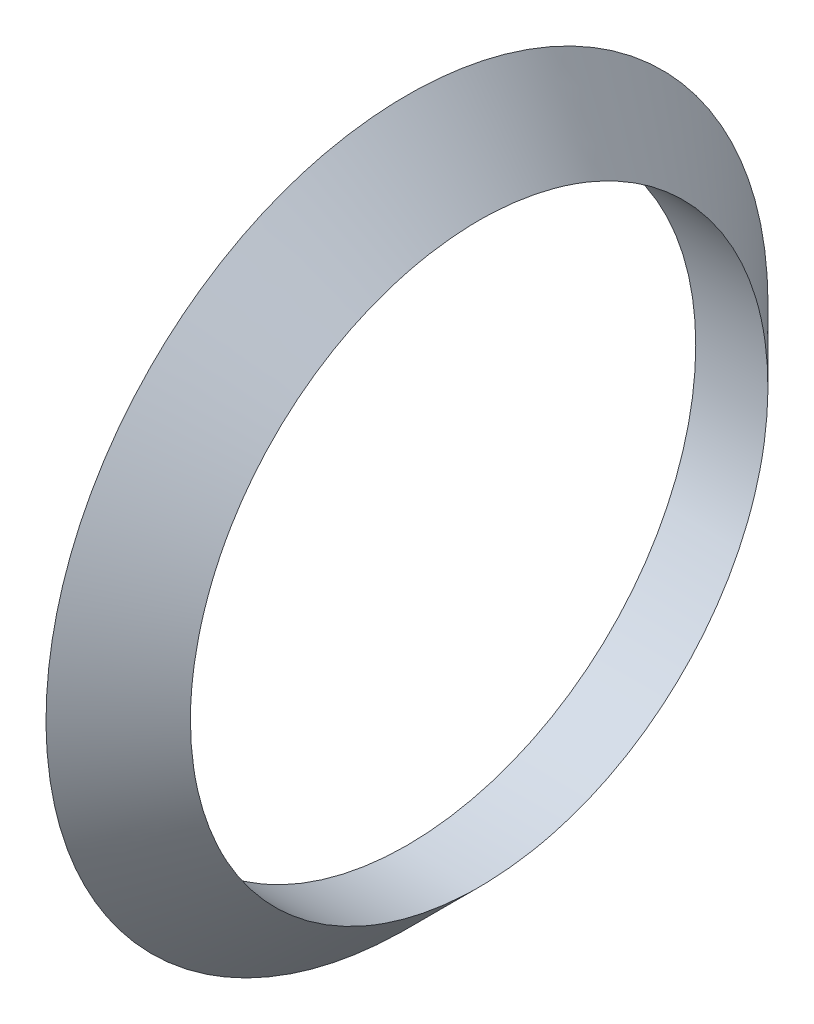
ISO-10303-21;
HEADER;
FILE_DESCRIPTION(('STEP AP214'),'2;1');
FILE_NAME('part.step','',(''),(''),'','','');
FILE_SCHEMA(('AUTOMOTIVE_DESIGN { 1 0 10303 214 1 1 1 1 }'));
ENDSEC;
DATA;
#1=APPLICATION_CONTEXT('core data for automotive mechanical design processes');
#2=APPLICATION_PROTOCOL_DEFINITION('international standard','automotive_design',2000,#1);
#3=PRODUCT_CONTEXT('',#1,'mechanical');
#4=PRODUCT('Part','Part','',(#3));
#5=PRODUCT_RELATED_PRODUCT_CATEGORY('part','',(#4));
#6=PRODUCT_DEFINITION_FORMATION('','',#4);
#7=PRODUCT_DEFINITION_CONTEXT('part definition',#1,'design');
#8=PRODUCT_DEFINITION('design','',#6,#7);
#9=PRODUCT_DEFINITION_SHAPE('','',#8);
#10=(LENGTH_UNIT() NAMED_UNIT(*) SI_UNIT(.MILLI.,.METRE.));
#11=(NAMED_UNIT(*) PLANE_ANGLE_UNIT() SI_UNIT($,.RADIAN.));
#12=(NAMED_UNIT(*) SI_UNIT($,.STERADIAN.) SOLID_ANGLE_UNIT());
#13=UNCERTAINTY_MEASURE_WITH_UNIT(LENGTH_MEASURE(1.E-05),#10,'distance_accuracy_value','');
#14=(GEOMETRIC_REPRESENTATION_CONTEXT(3) GLOBAL_UNCERTAINTY_ASSIGNED_CONTEXT((#13)) GLOBAL_UNIT_ASSIGNED_CONTEXT((#10,
#11,#12)) REPRESENTATION_CONTEXT('',''));
#15=CARTESIAN_POINT('',(0.,0.,0.));
#16=DIRECTION('',(0.,0.,1.));
#17=DIRECTION('',(1.,0.,0.));
#18=AXIS2_PLACEMENT_3D('',#15,#16,#17);
#19=CARTESIAN_POINT('',(152.,55.,27.));
#20=DIRECTION('',(-1.,0.,0.));
#21=DIRECTION('',(0.,0.,1.));
#22=AXIS2_PLACEMENT_3D('',#19,#20,#21);
#23=PLANE('',#22);
#24=CARTESIAN_POINT('',(152.,-1.10352807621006E-11,19.9998724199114));
#25=CARTESIAN_POINT('',(152.,0.244989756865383,19.9998783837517));
#26=CARTESIAN_POINT('',(152.,0.489954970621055,19.9955088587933));
#27=CARTESIAN_POINT('',(152.,0.979565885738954,19.9778506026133));
#28=CARTESIAN_POINT('',(152.,1.22421160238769,19.9645623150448));
#29=CARTESIAN_POINT('',(152.,1.71283709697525,19.9290391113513));
#30=CARTESIAN_POINT('',(152.,1.95681691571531,19.9068047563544));
#31=CARTESIAN_POINT('',(152.,2.44383325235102,19.8534078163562));
#32=CARTESIAN_POINT('',(152.,2.68686957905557,19.8222435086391));
#33=CARTESIAN_POINT('',(152.,3.41415854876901,19.7153111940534));
#34=CARTESIAN_POINT('',(152.,3.89651224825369,19.6261095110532));
#35=CARTESIAN_POINT('',(152.,4.853249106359,19.4122585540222));
#36=CARTESIAN_POINT('',(152.,5.3276319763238,19.2876079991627));
#37=CARTESIAN_POINT('',(152.,6.33487882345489,18.9825905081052));
#38=CARTESIAN_POINT('',(152.,6.86608978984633,18.796727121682));
#39=CARTESIAN_POINT('',(152.,7.91085705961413,18.380599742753));
#40=CARTESIAN_POINT('',(152.,8.42441159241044,18.1503313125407));
#41=CARTESIAN_POINT('',(152.,9.43044401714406,17.647106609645));
#42=CARTESIAN_POINT('',(152.,9.92291258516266,17.3741316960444));
#43=CARTESIAN_POINT('',(152.,10.8831031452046,16.7877001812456));
#44=CARTESIAN_POINT('',(152.,11.3508256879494,16.4742444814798));
#45=CARTESIAN_POINT('',(152.,12.2566972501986,15.8104072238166));
#46=CARTESIAN_POINT('',(152.,12.6949465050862,15.4601624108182));
#47=CARTESIAN_POINT('',(152.,13.5407301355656,14.7243493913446));
#48=CARTESIAN_POINT('',(152.,13.9482637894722,14.3387803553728));
#49=CARTESIAN_POINT('',(152.,14.7297504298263,13.5350482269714));
#50=CARTESIAN_POINT('',(152.,15.1037058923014,13.1168875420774));
#51=CARTESIAN_POINT('',(152.,15.8153610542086,12.2507735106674));
#52=CARTESIAN_POINT('',(152.,16.153061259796,11.802820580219));
#53=CARTESIAN_POINT('',(152.,16.7926480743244,10.8758849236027));
#54=CARTESIAN_POINT('',(152.,17.0941722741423,10.396652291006));
#55=CARTESIAN_POINT('',(152.,17.6556360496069,9.41433884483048));
#56=CARTESIAN_POINT('',(152.,17.9155761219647,8.91125831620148));
#57=CARTESIAN_POINT('',(152.,18.2727886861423,8.14162564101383));
#58=CARTESIAN_POINT('',(152.,18.3864218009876,7.88254695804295));
#59=CARTESIAN_POINT('',(152.,18.6025492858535,7.35984065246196));
#60=CARTESIAN_POINT('',(152.,18.7050465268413,7.09621422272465));
#61=CARTESIAN_POINT('',(152.,18.8986326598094,6.56479242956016));
#62=CARTESIAN_POINT('',(152.,18.989720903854,6.29699683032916));
#63=CARTESIAN_POINT('',(152.,19.1602610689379,5.75772578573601));
#64=CARTESIAN_POINT('',(152.,19.2397130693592,5.48625036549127));
#65=CARTESIAN_POINT('',(152.,19.3860625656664,4.94295472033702));
#66=CARTESIAN_POINT('',(152.,19.4530816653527,4.67116724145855));
#67=CARTESIAN_POINT('',(152.,19.5754672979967,4.12498736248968));
#68=CARTESIAN_POINT('',(152.,19.6308340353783,3.85059500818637));
#69=CARTESIAN_POINT('',(152.,19.7299923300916,3.29971527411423));
#70=CARTESIAN_POINT('',(152.,19.7737832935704,3.02322778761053));
#71=CARTESIAN_POINT('',(152.,19.849879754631,2.46867316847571));
#72=CARTESIAN_POINT('',(152.,19.8821850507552,2.19060600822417));
#73=CARTESIAN_POINT('',(152.,19.9352950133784,1.63329917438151));
#74=CARTESIAN_POINT('',(152.,19.9560965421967,1.35405920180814));
#75=CARTESIAN_POINT('',(152.,19.9861042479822,0.794960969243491));
#76=CARTESIAN_POINT('',(152.,19.9953106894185,0.515102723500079));
#77=CARTESIAN_POINT('',(152.,20.0019069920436,-0.0447562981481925));
#78=CARTESIAN_POINT('',(152.,19.9992967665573,-0.324757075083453));
#79=CARTESIAN_POINT('',(152.,19.9823608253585,-0.884406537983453));
#80=CARTESIAN_POINT('',(152.,19.9680348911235,-1.16405521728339));
#81=CARTESIAN_POINT('',(152.,19.9276889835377,-1.72455345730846));
#82=CARTESIAN_POINT('',(152.,19.9015846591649,-2.00539694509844));
#83=CARTESIAN_POINT('',(152.,19.8377117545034,-2.56575274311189));
#84=CARTESIAN_POINT('',(152.,19.7999431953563,-2.84526505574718));
#85=CARTESIAN_POINT('',(152.,19.7127211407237,-3.4024582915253));
#86=CARTESIAN_POINT('',(152.,19.6632680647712,-3.680139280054));
#87=CARTESIAN_POINT('',(152.,19.5525534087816,-4.23311645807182));
#88=CARTESIAN_POINT('',(152.,19.4912919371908,-4.50841266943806));
#89=CARTESIAN_POINT('',(152.,19.2898528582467,-5.32976534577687));
#90=CARTESIAN_POINT('',(152.,19.1319720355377,-5.87159756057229));
#91=CARTESIAN_POINT('',(152.,18.7703120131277,-6.93964824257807));
#92=CARTESIAN_POINT('',(152.,18.5665306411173,-7.46586596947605));
#93=CARTESIAN_POINT('',(152.,18.116959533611,-8.49532083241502));
#94=CARTESIAN_POINT('',(152.,17.8714979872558,-8.99870127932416));
#95=CARTESIAN_POINT('',(152.,17.3393324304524,-9.98314516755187));
#96=CARTESIAN_POINT('',(152.,17.0526298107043,-10.464209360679));
#97=CARTESIAN_POINT('',(152.,16.4398173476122,-11.4007904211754));
#98=CARTESIAN_POINT('',(152.,16.1136936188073,-11.8562982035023));
#99=CARTESIAN_POINT('',(152.,15.4245227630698,-12.7384810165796));
#100=CARTESIAN_POINT('',(152.,15.0614744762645,-13.1651551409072));
#101=CARTESIAN_POINT('',(152.,14.298437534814,-13.9897677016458));
#102=CARTESIAN_POINT('',(152.,13.8982036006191,-14.3874791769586));
#103=CARTESIAN_POINT('',(152.,13.0658328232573,-15.1479663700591));
#104=CARTESIAN_POINT('',(152.,12.6336968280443,-15.5107430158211));
#105=CARTESIAN_POINT('',(152.,11.7405266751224,-16.198544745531));
#106=CARTESIAN_POINT('',(152.,11.2794999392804,-16.5235794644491));
#107=CARTESIAN_POINT('',(152.,10.3316416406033,-17.1335984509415));
#108=CARTESIAN_POINT('',(152.,9.84480886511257,-17.4185808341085));
#109=CARTESIAN_POINT('',(152.,8.8476324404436,-17.9471688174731));
#110=CARTESIAN_POINT('',(152.,8.33723378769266,-18.1906706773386));
#111=CARTESIAN_POINT('',(152.,7.29768194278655,-18.6335359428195));
#112=CARTESIAN_POINT('',(152.,6.76853009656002,-18.8329025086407));
#113=CARTESIAN_POINT('',(152.,5.69484104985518,-19.1853814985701));
#114=CARTESIAN_POINT('',(152.,5.1503012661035,-19.3384861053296));
#115=CARTESIAN_POINT('',(152.,4.32527090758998,-19.5325199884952));
#116=CARTESIAN_POINT('',(152.,4.04885124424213,-19.5912665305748));
#117=CARTESIAN_POINT('',(152.,3.49373972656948,-19.6969307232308));
#118=CARTESIAN_POINT('',(152.,3.21504785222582,-19.7438482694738));
#119=CARTESIAN_POINT('',(152.,2.65960417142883,-19.8254302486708));
#120=CARTESIAN_POINT('',(152.,2.38287459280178,-19.8602467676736));
#121=CARTESIAN_POINT('',(152.,1.82821719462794,-19.9184663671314));
#122=CARTESIAN_POINT('',(152.,1.55028938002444,-19.9418694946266));
#123=CARTESIAN_POINT('',(152.,0.993708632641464,-19.9772003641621));
#124=CARTESIAN_POINT('',(152.,0.715055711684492,-19.989128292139));
#125=CARTESIAN_POINT('',(152.,0.157496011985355,-20.0013101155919));
#126=CARTESIAN_POINT('',(152.,-0.121410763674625,-20.0015641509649));
#127=CARTESIAN_POINT('',(152.,-0.678971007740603,-19.9903886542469));
#128=CARTESIAN_POINT('',(152.,-0.957624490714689,-19.9789598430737));
#129=CARTESIAN_POINT('',(152.,-1.51422688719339,-19.9446244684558));
#130=CARTESIAN_POINT('',(152.,-1.79217578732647,-19.921717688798));
#131=CARTESIAN_POINT('',(152.,-2.34689854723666,-19.8644900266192));
#132=CARTESIAN_POINT('',(152.,-2.62367239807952,-19.8301690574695));
#133=CARTESIAN_POINT('',(152.,-3.1755641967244,-19.7501207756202));
#134=CARTESIAN_POINT('',(152.,-3.45068216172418,-19.7043935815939));
#135=CARTESIAN_POINT('',(152.,-4.00382788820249,-19.6004656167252));
#136=CARTESIAN_POINT('',(152.,-4.28181531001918,-19.5420497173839));
#137=CARTESIAN_POINT('',(152.,-4.8350008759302,-19.4132332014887));
#138=CARTESIAN_POINT('',(152.,-5.11019901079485,-19.3428325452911));
#139=CARTESIAN_POINT('',(152.,-5.65728173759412,-19.1901677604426));
#140=CARTESIAN_POINT('',(152.,-5.92916636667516,-19.1079037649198));
#141=CARTESIAN_POINT('',(152.,-6.46911992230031,-18.9316841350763));
#142=CARTESIAN_POINT('',(152.,-6.73718882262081,-18.8377284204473));
#143=CARTESIAN_POINT('',(152.,-7.26901323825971,-18.6383752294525));
#144=CARTESIAN_POINT('',(152.,-7.53276915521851,-18.5329788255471));
#145=CARTESIAN_POINT('',(152.,-8.05553219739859,-18.3110519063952));
#146=CARTESIAN_POINT('',(152.,-8.31453930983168,-18.1945213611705));
#147=CARTESIAN_POINT('',(152.,-9.08376330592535,-17.8285542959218));
#148=CARTESIAN_POINT('',(152.,-9.58629391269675,-17.5627006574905));
#149=CARTESIAN_POINT('',(152.,-10.5579438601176,-16.9945384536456));
#150=CARTESIAN_POINT('',(152.,-11.0275052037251,-16.6929825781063));
#151=CARTESIAN_POINT('',(152.,-11.939822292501,-16.0517315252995));
#152=CARTESIAN_POINT('',(152.,-12.3825789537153,-15.7120376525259));
#153=CARTESIAN_POINT('',(152.,-13.2384182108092,-14.9969924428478));
#154=CARTESIAN_POINT('',(152.,-13.6514953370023,-14.6216345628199));
#155=CARTESIAN_POINT('',(152.,-14.4451618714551,-13.8380045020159));
#156=CARTESIAN_POINT('',(152.,-14.8257507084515,-13.4297317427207));
#157=CARTESIAN_POINT('',(152.,-15.5566349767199,-12.5772719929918));
#158=CARTESIAN_POINT('',(152.,-15.9064521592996,-12.1326746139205));
#159=CARTESIAN_POINT('',(152.,-16.5672335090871,-11.2154991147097));
#160=CARTESIAN_POINT('',(152.,-16.8781969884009,-10.7429204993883));
#161=CARTESIAN_POINT('',(152.,-17.4589941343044,-9.77323809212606));
#162=CARTESIAN_POINT('',(152.,-17.728840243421,-9.27614177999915));
#163=CARTESIAN_POINT('',(152.,-18.101307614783,-8.51487393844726));
#164=CARTESIAN_POINT('',(152.,-18.2200899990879,-8.25848776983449));
#165=CARTESIAN_POINT('',(152.,-18.4466999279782,-7.74089752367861));
#166=CARTESIAN_POINT('',(152.,-18.5545274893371,-7.4796934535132));
#167=CARTESIAN_POINT('',(152.,-18.7585971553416,-6.95378012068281));
#168=CARTESIAN_POINT('',(152.,-18.8548758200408,-6.68908503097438));
#169=CARTESIAN_POINT('',(152.,-19.0359969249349,-6.15580903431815));
#170=CARTESIAN_POINT('',(152.,-19.1208393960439,-5.88722813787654));
#171=CARTESIAN_POINT('',(152.,-19.2789004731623,-5.34666593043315));
#172=CARTESIAN_POINT('',(152.,-19.3521190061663,-5.07468459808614));
#173=CARTESIAN_POINT('',(152.,-19.4868037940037,-4.52782847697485));
#174=CARTESIAN_POINT('',(152.,-19.5482700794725,-4.25295369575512));
#175=CARTESIAN_POINT('',(152.,-19.6594315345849,-3.7007501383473));
#176=CARTESIAN_POINT('',(152.,-19.7091231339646,-3.42342064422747));
#177=CARTESIAN_POINT('',(152.,-19.7968457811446,-2.86692465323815));
#178=CARTESIAN_POINT('',(152.,-19.8348767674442,-2.58775814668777));
#179=CARTESIAN_POINT('',(152.,-19.8993005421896,-2.02808096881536));
#180=CARTESIAN_POINT('',(152.,-19.9256931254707,-1.74757027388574));
#181=CARTESIAN_POINT('',(152.,-19.9667892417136,-1.18569816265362));
#182=CARTESIAN_POINT('',(152.,-19.9814929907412,-0.904336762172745));
#183=CARTESIAN_POINT('',(152.,-19.9989999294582,-0.342695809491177));
#184=CARTESIAN_POINT('',(152.,-20.0018641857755,-0.0624181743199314));
#185=CARTESIAN_POINT('',(152.,-19.995749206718,0.498007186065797));
#186=CARTESIAN_POINT('',(152.,-19.9867699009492,0.778154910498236));
#187=CARTESIAN_POINT('',(152.,-19.9571896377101,1.33783814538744));
#188=CARTESIAN_POINT('',(152.,-19.9365887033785,1.617373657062));
#189=CARTESIAN_POINT('',(152.,-19.8838519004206,2.17533788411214));
#190=CARTESIAN_POINT('',(152.,-19.8517159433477,2.45376659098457));
#191=CARTESIAN_POINT('',(152.,-19.7380586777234,3.28650506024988));
#192=CARTESIAN_POINT('',(152.,-19.639272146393,3.8385662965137));
#193=CARTESIAN_POINT('',(152.,-19.3949503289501,4.93223120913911));
#194=CARTESIAN_POINT('',(152.,-19.2494183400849,5.47383562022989));
#195=CARTESIAN_POINT('',(152.,-18.9966141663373,6.27613268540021));
#196=CARTESIAN_POINT('',(152.,-18.9064183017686,6.5423092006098));
#197=CARTESIAN_POINT('',(152.,-18.7147568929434,7.07057086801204));
#198=CARTESIAN_POINT('',(152.,-18.6132913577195,7.33265602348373));
#199=CARTESIAN_POINT('',(152.,-18.2924069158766,8.11214604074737));
#200=CARTESIAN_POINT('',(152.,-18.0564758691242,8.62286235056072));
#201=CARTESIAN_POINT('',(152.,-17.5425219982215,9.62270405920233));
#202=CARTESIAN_POINT('',(152.,-17.264490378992,10.111824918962));
#203=CARTESIAN_POINT('',(152.,-16.6682719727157,11.0649443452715));
#204=CARTESIAN_POINT('',(152.,-16.3500872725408,11.5289442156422));
#205=CARTESIAN_POINT('',(152.,-15.6765851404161,12.4276112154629));
#206=CARTESIAN_POINT('',(152.,-15.321346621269,12.8623375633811));
#207=CARTESIAN_POINT('',(152.,-14.575753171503,13.7006568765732));
#208=CARTESIAN_POINT('',(152.,-14.1853979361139,14.1042495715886));
#209=CARTESIAN_POINT('',(152.,-13.5757023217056,14.6841373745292));
#210=CARTESIAN_POINT('',(152.,-13.3683903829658,14.8732256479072));
#211=CARTESIAN_POINT('',(152.,-12.9461062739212,15.2425342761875));
#212=CARTESIAN_POINT('',(152.,-12.7311360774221,15.4227568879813));
#213=CARTESIAN_POINT('',(152.,-12.0751694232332,15.9497291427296));
#214=CARTESIAN_POINT('',(152.,-11.6230736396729,16.2828243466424));
#215=CARTESIAN_POINT('',(152.,-10.6884257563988,16.912751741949));
#216=CARTESIAN_POINT('',(152.,-10.2056361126,17.2092304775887));
#217=CARTESIAN_POINT('',(152.,-9.21658508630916,17.7601644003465));
#218=CARTESIAN_POINT('',(152.,-8.7103225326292,18.0146174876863));
#219=CARTESIAN_POINT('',(152.,-7.6783932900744,18.4792434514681));
#220=CARTESIAN_POINT('',(152.,-7.15274322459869,18.6894532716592));
#221=CARTESIAN_POINT('',(152.,-6.08545955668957,19.0641708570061));
#222=CARTESIAN_POINT('',(152.,-5.54382897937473,19.2286872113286));
#223=CARTESIAN_POINT('',(152.,-4.58872093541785,19.4747306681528));
#224=CARTESIAN_POINT('',(152.,-4.17790054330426,19.5667215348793));
#225=CARTESIAN_POINT('',(152.,-3.35122502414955,19.7244487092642));
#226=CARTESIAN_POINT('',(152.,-2.93537021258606,19.7901866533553));
#227=CARTESIAN_POINT('',(152.,-2.30917935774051,19.8689853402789));
#228=CARTESIAN_POINT('',(152.,-2.1000423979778,19.891950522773));
#229=CARTESIAN_POINT('',(152.,-1.68118274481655,19.9313074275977));
#230=CARTESIAN_POINT('',(152.,-1.47146014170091,19.9477001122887));
#231=CARTESIAN_POINT('',(152.,-0.841581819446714,19.9869460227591));
#232=CARTESIAN_POINT('',(152.,-0.420754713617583,19.9998621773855));
#233=CARTESIAN_POINT('',(152.,-1.10352807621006E-11,19.9998724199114));
#234=B_SPLINE_CURVE_WITH_KNOTS('',3,(#24,#25,#26,#27,#28,#29,#30,#31,#32,#33,#34,#35,#36,#37,
#38,#39,#40,#41,#42,#43,#44,#45,#46,#47,#48,#49,#50,#51,#52,#53,#54,#55,#56,#57,#58,#59,#60,#61,
#62,#63,#64,#65,#66,#67,#68,#69,#70,#71,#72,#73,#74,#75,#76,#77,#78,#79,#80,#81,#82,#83,#84,#85,
#86,#87,#88,#89,#90,#91,#92,#93,#94,#95,#96,#97,#98,#99,#100,#101,#102,#103,#104,#105,#106,#107,
#108,#109,#110,#111,#112,#113,#114,#115,#116,#117,#118,#119,#120,#121,#122,#123,#124,#125,#126,
#127,#128,#129,#130,#131,#132,#133,#134,#135,#136,#137,#138,#139,#140,#141,#142,#143,#144,#145,
#146,#147,#148,#149,#150,#151,#152,#153,#154,#155,#156,#157,#158,#159,#160,#161,#162,#163,#164,
#165,#166,#167,#168,#169,#170,#171,#172,#173,#174,#175,#176,#177,#178,#179,#180,#181,#182,#183,
#184,#185,#186,#187,#188,#189,#190,#191,#192,#193,#194,#195,#196,#197,#198,#199,#200,#201,#202,
#203,#204,#205,#206,#207,#208,#209,#210,#211,#212,#213,#214,#215,#216,#217,#218,#219,#220,#221,
#222,#223,#224,#225,#226,#227,#228,#229,#230,#231,#232,#233),.UNSPECIFIED.,.T.,.F.,(4,2,2,2,2,2,
2,2,2,2,2,2,2,2,2,2,2,2,2,2,2,2,2,2,2,2,2,2,2,2,2,2,2,2,2,2,2,2,2,2,2,2,2,2,2,2,2,2,2,2,2,2,2,2,
2,2,2,2,2,2,2,2,2,2,2,2,2,2,2,2,2,2,2,2,2,2,2,2,2,2,2,2,2,2,2,2,2,2,2,2,2,2,2,2,2,2,2,2,2,2,2,2,
2,2,4),(0.,0.73488494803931,1.46973334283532,2.20453565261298,2.93947981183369,4.40960497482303,
5.87978326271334,7.56605586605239,9.25249707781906,10.9396764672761,12.6268182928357,
14.3078971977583,15.9890155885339,17.6700099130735,19.3509807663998,21.047590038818,
22.7441790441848,23.5926803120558,24.4409623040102,25.2892924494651,26.137616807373,
26.9771473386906,27.8166631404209,28.6562220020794,29.4957955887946,30.3355980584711,
31.1753813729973,32.0151708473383,32.8549759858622,33.7008932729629,34.5468090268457,
35.3926944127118,36.2385720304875,37.9293840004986,39.6202760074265,41.298423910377,
42.9765152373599,44.6551993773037,46.3339362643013,48.024661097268,49.7153410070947,
51.4055883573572,53.0959152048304,54.7904092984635,56.484782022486,58.1794409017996,
59.02700863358,59.8745838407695,60.711084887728,61.5475824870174,62.3840665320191,
63.2205405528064,64.0569629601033,64.8934011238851,65.729845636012,66.5662814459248,
67.4181926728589,68.2701067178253,69.1220112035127,69.9739215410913,70.8257520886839,
71.6775849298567,73.38089587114,75.0531641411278,76.725375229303,78.3978937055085,
80.0704415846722,81.7655657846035,83.4607199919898,85.1553602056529,86.0028492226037,
86.850336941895,87.6950667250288,88.5397942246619,89.3845270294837,90.2292576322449,
91.0742440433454,91.9192349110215,92.7642406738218,93.6092308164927,94.4498571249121,
95.2904884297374,96.131118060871,96.9717541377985,98.6521304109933,100.332388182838,
101.175292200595,102.01819554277,103.703761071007,105.38967921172,107.075509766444,
108.757820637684,110.440146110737,111.28171507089,112.123068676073,113.805597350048,
115.503273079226,117.201033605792,118.897370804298,120.593388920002,121.85559088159,
123.117714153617,123.748807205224,124.379807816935,125.641927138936),.UNSPECIFIED.);
#235=CARTESIAN_POINT('',(152.,-1.10352807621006E-11,19.9998724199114));
#236=VERTEX_POINT('',#235);
#237=EDGE_CURVE('E43',#236,#236,#234,.T.);
#238=ORIENTED_EDGE('',*,*,#237,.T.);
#239=EDGE_LOOP('',(#238));
#240=FACE_BOUND('',#239,.T.);
#241=CARTESIAN_POINT('',(152.,0.,0.));
#242=DIRECTION('',(-1.,0.,0.));
#243=DIRECTION('',(0.,-1.,0.));
#244=AXIS2_PLACEMENT_3D('',#241,#242,#243);
#245=CIRCLE('',#244,16.);
#246=CARTESIAN_POINT('',(152.,-16.,0.));
#247=VERTEX_POINT('',#246);
#248=EDGE_CURVE('E48',#247,#247,#245,.T.);
#249=ORIENTED_EDGE('',*,*,#248,.F.);
#250=EDGE_LOOP('',(#249));
#251=FACE_BOUND('',#250,.T.);
#252=ADVANCED_FACE('F29',(#240,#251),#23,.T.);
#253=CARTESIAN_POINT('',(-128.,0.,0.));
#254=DIRECTION('',(-1.,0.,0.));
#255=DIRECTION('',(0.,0.0562040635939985,0.998419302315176));
#256=AXIS2_PLACEMENT_3D('',#253,#254,#255);
#257=CYLINDRICAL_SURFACE('',#256,16.);
#258=CARTESIAN_POINT('',(155.999897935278,3.54670539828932E-13,16.));
#259=CARTESIAN_POINT('',(155.999900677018,-0.224746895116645,16.0000002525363));
#260=CARTESIAN_POINT('',(156.000042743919,-0.449486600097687,15.9952640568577));
#261=CARTESIAN_POINT('',(156.000378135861,-0.8985700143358,15.9763286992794));
#262=CARTESIAN_POINT('',(156.000571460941,-1.12291372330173,15.9621295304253));
#263=CARTESIAN_POINT('',(156.001001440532,-1.5708387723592,15.9242891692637));
#264=CARTESIAN_POINT('',(156.001238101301,-1.7944199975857,15.9006466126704));
#265=CARTESIAN_POINT('',(156.001703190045,-2.24042725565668,15.8439593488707));
#266=CARTESIAN_POINT('',(156.001931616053,-2.46285300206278,15.810912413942));
#267=CARTESIAN_POINT('',(156.00254337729,-3.12814494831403,15.6976794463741));
#268=CARTESIAN_POINT('',(156.002852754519,-3.56869782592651,15.6034289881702));
#269=CARTESIAN_POINT('',(156.003136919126,-4.44028724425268,15.3781164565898));
#270=CARTESIAN_POINT('',(156.003111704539,-4.87132372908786,15.2470541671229));
#271=CARTESIAN_POINT('',(156.002837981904,-5.50827915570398,15.0236317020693));
#272=CARTESIAN_POINT('',(156.00270744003,-5.71898465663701,14.9446919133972));
#273=CARTESIAN_POINT('',(156.002381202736,-6.13682572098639,14.7780226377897));
#274=CARTESIAN_POINT('',(156.002185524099,-6.34396218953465,14.6902954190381));
#275=CARTESIAN_POINT('',(156.001524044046,-6.95958727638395,14.4141038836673));
#276=CARTESIAN_POINT('',(156.000983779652,-7.36232466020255,14.2126180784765));
#277=CARTESIAN_POINT('',(155.999865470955,-8.14923822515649,13.7765122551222));
#278=CARTESIAN_POINT('',(155.999287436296,-8.53341910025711,13.5419006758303));
#279=CARTESIAN_POINT('',(155.998255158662,-9.28066692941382,13.041145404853));
#280=CARTESIAN_POINT('',(155.997800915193,-9.6437339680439,12.7750018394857));
#281=CARTESIAN_POINT('',(155.997137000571,-10.3461967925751,12.2130486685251));
#282=CARTESIAN_POINT('',(155.996927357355,-10.6855898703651,11.9172356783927));
#283=CARTESIAN_POINT('',(155.996815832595,-11.3382516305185,11.2980697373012));
#284=CARTESIAN_POINT('',(155.996913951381,-11.6515202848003,10.9747167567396));
#285=CARTESIAN_POINT('',(155.997361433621,-12.2497160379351,10.3027573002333));
#286=CARTESIAN_POINT('',(155.997710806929,-12.5346420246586,9.95414983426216));
#287=CARTESIAN_POINT('',(155.998508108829,-13.0741130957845,9.23417112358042));
#288=CARTESIAN_POINT('',(155.9989560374,-13.3286581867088,8.86279988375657));
#289=CARTESIAN_POINT('',(155.999897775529,-13.8055504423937,8.09994523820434));
#290=CARTESIAN_POINT('',(156.00039158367,-14.0278985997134,7.70846245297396));
#291=CARTESIAN_POINT('',(156.001473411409,-14.4388254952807,6.90815888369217));
#292=CARTESIAN_POINT('',(156.00206143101,-14.6274042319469,6.49933809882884));
#293=CARTESIAN_POINT('',(156.00311405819,-14.9694518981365,5.66725991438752));
#294=CARTESIAN_POINT('',(156.003578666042,-15.1229209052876,5.24400254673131));
#295=CARTESIAN_POINT('',(156.003796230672,-15.3936566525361,4.38608022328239));
#296=CARTESIAN_POINT('',(156.003549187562,-15.5109233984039,3.95141526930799));
#297=CARTESIAN_POINT('',(156.002435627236,-15.7084262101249,3.07369754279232));
#298=CARTESIAN_POINT('',(156.001569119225,-15.7886628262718,2.6306448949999));
#299=CARTESIAN_POINT('',(156.000659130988,-15.8808066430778,1.96230023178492));
#300=CARTESIAN_POINT('',(156.000420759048,-15.9068207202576,1.73886602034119));
#301=CARTESIAN_POINT('',(156.000097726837,-15.9494094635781,1.29108422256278));
#302=CARTESIAN_POINT('',(156.000013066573,-15.9659841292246,1.0667366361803));
#303=CARTESIAN_POINT('',(155.999959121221,-15.9896599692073,0.617546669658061));
#304=CARTESIAN_POINT('',(155.999989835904,-15.9967611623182,0.392704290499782));
#305=CARTESIAN_POINT('',(155.999999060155,-16.0014787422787,-0.0570809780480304));
#306=CARTESIAN_POINT('',(155.999977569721,-15.9990951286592,-0.282023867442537));
#307=CARTESIAN_POINT('',(155.999970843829,-15.9848469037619,-0.731609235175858));
#308=CARTESIAN_POINT('',(155.999985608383,-15.9729822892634,-0.956251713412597));
#309=CARTESIAN_POINT('',(156.00016224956,-15.9397936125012,-1.40483579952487));
#310=CARTESIAN_POINT('',(156.000324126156,-15.918469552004,-1.62877740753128));
#311=CARTESIAN_POINT('',(156.000796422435,-15.8663994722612,-2.0755580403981));
#312=CARTESIAN_POINT('',(156.001106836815,-15.8356537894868,-2.29839710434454));
#313=CARTESIAN_POINT('',(156.001807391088,-15.7647968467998,-2.74258688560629));
#314=CARTESIAN_POINT('',(156.00219753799,-15.7246847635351,-2.96393747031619));
#315=CARTESIAN_POINT('',(156.003197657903,-15.5904047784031,-3.62511586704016));
#316=CARTESIAN_POINT('',(156.003637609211,-15.4822791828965,-4.06218995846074));
#317=CARTESIAN_POINT('',(156.003764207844,-15.2295814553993,-4.92566941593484));
#318=CARTESIAN_POINT('',(156.003450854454,-15.0850092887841,-5.35207477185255));
#319=CARTESIAN_POINT('',(156.002732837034,-14.8416434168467,-5.98132454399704));
#320=CARTESIAN_POINT('',(156.002452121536,-14.7560925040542,-6.18937071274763));
#321=CARTESIAN_POINT('',(156.001894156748,-14.576299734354,-6.60167168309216));
#322=CARTESIAN_POINT('',(156.001616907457,-14.4820578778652,-6.80592648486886));
#323=CARTESIAN_POINT('',(156.000802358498,-14.186540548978,-7.4124391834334));
#324=CARTESIAN_POINT('',(156.000282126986,-13.9724371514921,-7.80853885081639));
#325=CARTESIAN_POINT('',(155.999301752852,-13.5116509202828,-8.58124158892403));
#326=CARTESIAN_POINT('',(155.998841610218,-13.2649680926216,-8.95784466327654));
#327=CARTESIAN_POINT('',(155.997973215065,-12.7407470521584,-9.68894540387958));
#328=CARTESIAN_POINT('',(155.997564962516,-12.463208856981,-10.0434430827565));
#329=CARTESIAN_POINT('',(155.997000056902,-11.8792575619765,-10.7277949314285));
#330=CARTESIAN_POINT('',(155.996843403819,-11.5728444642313,-11.0576491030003));
#331=CARTESIAN_POINT('',(155.996884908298,-10.9333156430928,-11.6903784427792));
#332=CARTESIAN_POINT('',(155.997083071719,-10.6001994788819,-11.9932531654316));
#333=CARTESIAN_POINT('',(155.997707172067,-9.90963301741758,-12.5698649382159));
#334=CARTESIAN_POINT('',(155.998133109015,-9.55218271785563,-12.8436019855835));
#335=CARTESIAN_POINT('',(155.999020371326,-8.81550686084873,-13.3599851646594));
#336=CARTESIAN_POINT('',(155.999481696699,-8.43628129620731,-13.6026312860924));
#337=CARTESIAN_POINT('',(156.000474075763,-7.65868383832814,-14.0551361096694));
#338=CARTESIAN_POINT('',(156.001005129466,-7.26031194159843,-14.2649948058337));
#339=CARTESIAN_POINT('',(156.001828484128,-6.65066099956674,-14.5540145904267));
#340=CARTESIAN_POINT('',(156.002107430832,-6.44540479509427,-14.6460686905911));
#341=CARTESIAN_POINT('',(156.002658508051,-6.03120116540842,-14.8214439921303));
#342=CARTESIAN_POINT('',(156.002930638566,-5.82225374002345,-14.9047651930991));
#343=CARTESIAN_POINT('',(156.003584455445,-5.1904015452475,-15.141396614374));
#344=CARTESIAN_POINT('',(156.003803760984,-4.76239593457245,-15.2814177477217));
#345=CARTESIAN_POINT('',(156.003589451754,-4.11286446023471,-15.4639909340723));
#346=CARTESIAN_POINT('',(156.003427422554,-3.89507550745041,-15.5202769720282));
#347=CARTESIAN_POINT('',(156.002941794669,-3.45729836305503,-15.6236244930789));
#348=CARTESIAN_POINT('',(156.002618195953,-3.23731017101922,-15.670685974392));
#349=CARTESIAN_POINT('',(156.001911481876,-2.79555068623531,-15.7554908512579));
#350=CARTESIAN_POINT('',(156.001528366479,-2.57377939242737,-15.7932342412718));
#351=CARTESIAN_POINT('',(156.000869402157,-2.12884121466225,-15.8593384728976));
#352=CARTESIAN_POINT('',(156.000593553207,-1.90567433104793,-15.8876993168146));
#353=CARTESIAN_POINT('',(156.00019529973,-1.45834733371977,-15.9349869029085));
#354=CARTESIAN_POINT('',(156.000072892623,-1.23418723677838,-15.9539138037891));
#355=CARTESIAN_POINT('',(155.999963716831,-0.785268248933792,-15.9823007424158));
#356=CARTESIAN_POINT('',(155.999976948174,-0.560509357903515,-15.9917607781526));
#357=CARTESIAN_POINT('',(155.999989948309,-0.110792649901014,-16.0011970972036));
#358=CARTESIAN_POINT('',(155.999989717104,0.114165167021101,-16.0011733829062));
#359=CARTESIAN_POINT('',(155.999976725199,0.563879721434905,-15.9916422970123));
#360=CARTESIAN_POINT('',(155.999963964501,0.788636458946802,-15.9821349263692));
#361=CARTESIAN_POINT('',(156.000074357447,1.2375496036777,-15.9536533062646));
#362=CARTESIAN_POINT('',(156.000197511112,1.46170601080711,-15.9346790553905));
#363=CARTESIAN_POINT('',(156.00059731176,1.90901845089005,-15.8872978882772));
#364=CARTESIAN_POINT('',(156.00087395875,2.13217448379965,-15.8588909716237));
#365=CARTESIAN_POINT('',(156.001533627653,2.57709430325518,-15.792693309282));
#366=CARTESIAN_POINT('',(156.001916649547,2.79885809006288,-15.7549025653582));
#367=CARTESIAN_POINT('',(156.002623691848,3.24058077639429,-15.6700107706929));
#368=CARTESIAN_POINT('',(156.002947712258,3.46053967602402,-15.6229097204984));
#369=CARTESIAN_POINT('',(156.003668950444,4.11713082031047,-15.4677537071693));
#370=CARTESIAN_POINT('',(156.003815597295,4.55057540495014,-15.3458313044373));
#371=CARTESIAN_POINT('',(156.003442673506,5.4055928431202,-15.065921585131));
#372=CARTESIAN_POINT('',(156.00292310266,5.82716569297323,-14.9079342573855));
#373=CARTESIAN_POINT('',(156.001834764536,6.6555198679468,-14.5570035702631));
#374=CARTESIAN_POINT('',(156.001265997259,7.06230119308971,-14.3640602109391));
#375=CARTESIAN_POINT('',(156.000213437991,7.85816000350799,-13.9445928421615));
#376=CARTESIAN_POINT('',(155.999729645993,8.24723749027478,-13.7180688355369));
#377=CARTESIAN_POINT('',(155.998786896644,9.00492391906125,-13.2330522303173));
#378=CARTESIAN_POINT('',(155.998327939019,9.3735330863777,-12.9745599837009));
#379=CARTESIAN_POINT('',(155.997533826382,10.0876656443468,-12.427442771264));
#380=CARTESIAN_POINT('',(155.997198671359,10.4331890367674,-12.138817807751));
#381=CARTESIAN_POINT('',(155.996840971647,11.0986941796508,-11.5334867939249));
#382=CARTESIAN_POINT('',(155.996818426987,11.418675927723,-11.2167807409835));
#383=CARTESIAN_POINT('',(155.997101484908,12.0308226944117,-10.5575393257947));
#384=CARTESIAN_POINT('',(155.997407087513,12.3229877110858,-10.2150039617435));
#385=CARTESIAN_POINT('',(155.99816799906,12.8774280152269,-9.50653368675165));
#386=CARTESIAN_POINT('',(155.998623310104,13.1397028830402,-9.14059844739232));
#387=CARTESIAN_POINT('',(155.999555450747,13.6324934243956,-8.38793557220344));
#388=CARTESIAN_POINT('',(156.000032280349,13.8630090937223,-8.0012079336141));
#389=CARTESIAN_POINT('',(156.001064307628,14.2906432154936,-7.20970465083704));
#390=CARTESIAN_POINT('',(156.001619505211,14.48776170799,-6.80492902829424));
#391=CARTESIAN_POINT('',(156.002734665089,14.8471964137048,-5.98022767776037));
#392=CARTESIAN_POINT('',(156.003294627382,15.0095126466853,-5.56030195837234));
#393=CARTESIAN_POINT('',(156.003801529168,15.2982063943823,-4.70820165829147));
#394=CARTESIAN_POINT('',(156.003748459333,15.4245833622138,-4.27602689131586));
#395=CARTESIAN_POINT('',(156.003149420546,15.5864880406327,-3.62105449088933));
#396=CARTESIAN_POINT('',(156.002863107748,15.6358500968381,-3.40158715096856));
#397=CARTESIAN_POINT('',(156.002188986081,15.7252825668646,-2.9607518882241));
#398=CARTESIAN_POINT('',(156.001801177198,15.7653529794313,-2.73938396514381));
#399=CARTESIAN_POINT('',(156.001102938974,15.8361244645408,-2.2951590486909));
#400=CARTESIAN_POINT('',(156.000792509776,15.8668255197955,-2.07230205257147));
#401=CARTESIAN_POINT('',(156.00032113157,15.9188053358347,-1.62549068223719));
#402=CARTESIAN_POINT('',(156.000160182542,15.9400840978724,-1.40153630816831));
#403=CARTESIAN_POINT('',(155.99998504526,15.9731809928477,-0.952929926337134));
#404=CARTESIAN_POINT('',(155.999970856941,15.9849991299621,-0.728277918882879));
#405=CARTESIAN_POINT('',(155.999977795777,15.9991539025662,-0.278675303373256));
#406=CARTESIAN_POINT('',(155.999998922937,16.0014905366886,-0.0537246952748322));
#407=CARTESIAN_POINT('',(155.999989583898,15.9966781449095,0.39607104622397));
#408=CARTESIAN_POINT('',(155.999959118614,15.9895292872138,0.620916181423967));
#409=CARTESIAN_POINT('',(156.000013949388,15.9657589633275,1.0701050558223));
#410=CARTESIAN_POINT('',(156.000099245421,15.9491374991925,1.29444879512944));
#411=CARTESIAN_POINT('',(156.00042410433,15.9064513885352,1.7422363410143));
#412=CARTESIAN_POINT('',(156.000663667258,15.8803867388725,1.96568014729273));
#413=CARTESIAN_POINT('',(156.001270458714,15.8188611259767,2.41126911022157));
#414=CARTESIAN_POINT('',(156.001637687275,15.7834001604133,2.6334142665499));
#415=CARTESIAN_POINT('',(156.002360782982,15.7031430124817,3.07601644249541));
#416=CARTESIAN_POINT('',(156.002716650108,15.6583468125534,3.29647345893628));
#417=CARTESIAN_POINT('',(156.003276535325,15.5595057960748,3.73528866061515));
#418=CARTESIAN_POINT('',(156.003480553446,15.505460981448,3.95364684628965));
#419=CARTESIAN_POINT('',(156.003818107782,15.32958495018,4.60499702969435));
#420=CARTESIAN_POINT('',(156.003677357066,15.1939942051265,5.03436352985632));
#421=CARTESIAN_POINT('',(156.002929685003,14.8871400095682,5.88009313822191));
#422=CARTESIAN_POINT('',(156.002322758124,14.7158761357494,6.296456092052));
#423=CARTESIAN_POINT('',(156.001181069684,14.3388772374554,7.11329060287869));
#424=CARTESIAN_POINT('',(156.000646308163,14.1331421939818,7.5137621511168));
#425=CARTESIAN_POINT('',(155.999649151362,13.6886767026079,8.29593086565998));
#426=CARTESIAN_POINT('',(155.999186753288,13.4499475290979,8.67762875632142));
#427=CARTESIAN_POINT('',(155.998303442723,12.9411838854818,9.41955839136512));
#428=CARTESIAN_POINT('',(155.997882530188,12.671149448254,9.77979015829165));
#429=CARTESIAN_POINT('',(155.997224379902,12.1017185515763,10.4761968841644));
#430=CARTESIAN_POINT('',(155.996987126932,11.8023245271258,10.8123738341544));
#431=CARTESIAN_POINT('',(155.996808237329,11.1762824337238,11.4583159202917));
#432=CARTESIAN_POINT('',(155.99686660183,10.8496342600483,11.768080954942));
#433=CARTESIAN_POINT('',(155.997269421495,10.1713201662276,12.359071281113));
#434=CARTESIAN_POINT('',(155.997613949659,9.81964788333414,12.6402892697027));
#435=CARTESIAN_POINT('',(155.998493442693,9.09386585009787,13.1720914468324));
#436=CARTESIAN_POINT('',(155.999028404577,8.7197564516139,13.422676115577));
#437=CARTESIAN_POINT('',(156.000144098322,7.95157782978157,13.8915438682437));
#438=CARTESIAN_POINT('',(156.000724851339,7.5574994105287,14.1098118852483));
#439=CARTESIAN_POINT('',(156.001764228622,6.75234080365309,14.5123556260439));
#440=CARTESIAN_POINT('',(156.002222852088,6.34126050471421,14.6966311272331));
#441=CARTESIAN_POINT('',(156.002872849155,5.505492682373,15.0296945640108));
#442=CARTESIAN_POINT('',(156.003064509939,5.0808202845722,15.1785204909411));
#443=CARTESIAN_POINT('',(156.003105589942,4.22051934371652,15.4398576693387));
#444=CARTESIAN_POINT('',(156.002955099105,3.78489370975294,15.5523784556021));
#445=CARTESIAN_POINT('',(156.002483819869,3.07071293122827,15.7050845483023));
#446=CARTESIAN_POINT('',(156.002248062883,2.79452043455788,15.7565721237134));
#447=CARTESIAN_POINT('',(156.001706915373,2.23981522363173,15.8449383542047));
#448=CARTESIAN_POINT('',(156.001401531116,1.96130272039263,15.8818183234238));
#449=CARTESIAN_POINT('',(156.00083839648,1.40274723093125,15.9408649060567));
#450=CARTESIAN_POINT('',(156.000580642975,1.12270434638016,15.9630324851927));
#451=CARTESIAN_POINT('',(156.000108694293,0.561770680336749,15.9926015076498));
#452=CARTESIAN_POINT('',(155.999894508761,0.280879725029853,15.9999996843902));
#453=CARTESIAN_POINT('',(155.999897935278,3.54670539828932E-13,16.));
#454=B_SPLINE_CURVE_WITH_KNOTS('',3,(#258,#259,#260,#261,#262,#263,#264,#265,#266,#267,#268,
#269,#270,#271,#272,#273,#274,#275,#276,#277,#278,#279,#280,#281,#282,#283,#284,#285,#286,#287,
#288,#289,#290,#291,#292,#293,#294,#295,#296,#297,#298,#299,#300,#301,#302,#303,#304,#305,#306,
#307,#308,#309,#310,#311,#312,#313,#314,#315,#316,#317,#318,#319,#320,#321,#322,#323,#324,#325,
#326,#327,#328,#329,#330,#331,#332,#333,#334,#335,#336,#337,#338,#339,#340,#341,#342,#343,#344,
#345,#346,#347,#348,#349,#350,#351,#352,#353,#354,#355,#356,#357,#358,#359,#360,#361,#362,#363,
#364,#365,#366,#367,#368,#369,#370,#371,#372,#373,#374,#375,#376,#377,#378,#379,#380,#381,#382,
#383,#384,#385,#386,#387,#388,#389,#390,#391,#392,#393,#394,#395,#396,#397,#398,#399,#400,#401,
#402,#403,#404,#405,#406,#407,#408,#409,#410,#411,#412,#413,#414,#415,#416,#417,#418,#419,#420,
#421,#422,#423,#424,#425,#426,#427,#428,#429,#430,#431,#432,#433,#434,#435,#436,#437,#438,#439,
#440,#441,#442,#443,#444,#445,#446,#447,#448,#449,#450,#451,#452,#453),.UNSPECIFIED.,.T.,.F.,(4,
2,2,2,2,2,2,2,2,2,2,2,2,2,2,2,2,2,2,2,2,2,2,2,2,2,2,2,2,2,2,2,2,2,2,2,2,2,2,2,2,2,2,2,2,2,2,2,2,
2,2,2,2,2,2,2,2,2,2,2,2,2,2,2,2,2,2,2,2,2,2,2,2,2,2,2,2,2,2,2,2,2,2,2,2,2,2,2,2,2,2,2,2,2,2,2,2,
4),(0.,0.674177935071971,1.34835636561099,2.02263222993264,2.69706795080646,4.04692381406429,
5.39678760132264,6.07163368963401,6.74630603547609,8.09554587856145,9.44444261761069,
10.7933339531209,12.1423793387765,13.4914261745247,14.8405259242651,16.1896253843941,
17.5386832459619,18.8877411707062,20.236796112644,21.5858508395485,22.9348855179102,
23.609552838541,24.2842201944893,24.9588862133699,25.6335522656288,26.3082185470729,
26.9828847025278,27.6575267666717,28.3322281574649,29.6812707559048,31.0303146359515,
31.7049870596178,32.3796594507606,33.7287045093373,35.0777493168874,36.4267933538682,
37.7758372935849,39.124903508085,40.4739698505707,41.8230366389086,43.1721036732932,
43.8467886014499,44.5214735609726,45.8705425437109,46.5452269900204,47.2199115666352,
47.8945965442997,48.5692813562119,49.243954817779,49.9186284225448,50.5933018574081,
51.2679752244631,51.9426486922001,52.6173221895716,53.2919955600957,53.966668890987,
55.3157195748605,56.6647706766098,58.0138217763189,59.3628727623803,60.7119088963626,
62.0609449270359,63.4099810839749,64.7590173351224,66.1080725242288,67.4571278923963,
68.8061816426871,70.1552346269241,71.504308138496,72.1789952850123,72.8536825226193,
73.5283710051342,74.2030593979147,74.8777474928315,75.5524356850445,76.2271119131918,
76.901787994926,77.5764643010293,78.2511407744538,78.9258185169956,79.6004961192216,
80.9495508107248,82.2986215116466,83.6476929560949,84.9967123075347,86.3457302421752,
87.6946363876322,89.0435477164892,90.3928032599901,91.7420376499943,93.091899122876,
94.4417694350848,95.7901865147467,97.1382491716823,97.9807547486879,98.8231845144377,
99.6655589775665,100.508119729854),.UNSPECIFIED.);
#455=CARTESIAN_POINT('',(155.999897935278,7.18390555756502E-13,16.));
#456=VERTEX_POINT('',#455);
#457=EDGE_CURVE('E10',#456,#456,#454,.T.);
#458=ORIENTED_EDGE('',*,*,#457,.T.);
#459=EDGE_LOOP('',(#458));
#460=FACE_BOUND('',#459,.T.);
#461=ORIENTED_EDGE('',*,*,#248,.T.);
#462=EDGE_LOOP('',(#461));
#463=FACE_BOUND('',#462,.T.);
#464=ADVANCED_FACE('F54',(#460,#463),#257,.F.);
#465=CARTESIAN_POINT('',(156.04,8.36272240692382E-13,15.9598981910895));
#466=CARTESIAN_POINT('',(156.04,0.21961609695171,15.9598981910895));
#467=CARTESIAN_POINT('',(156.04,0.658848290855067,15.9510606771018));
#468=CARTESIAN_POINT('',(156.04,1.30930266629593,15.9113490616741));
#469=CARTESIAN_POINT('',(156.04,1.95295679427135,15.8458491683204));
#470=CARTESIAN_POINT('',(156.04,5.76765224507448,15.3012269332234));
#471=CARTESIAN_POINT('',(156.04,9.91452695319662,13.0918627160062));
#472=CARTESIAN_POINT('',(156.04,13.3122729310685,8.97936144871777));
#473=CARTESIAN_POINT('',(156.04,14.7952337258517,6.25536306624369));
#474=CARTESIAN_POINT('',(156.04,15.7365176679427,3.25836279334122));
#475=CARTESIAN_POINT('',(156.04,16.071740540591,3.27599385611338E-07));
#476=CARTESIAN_POINT('',(156.04,15.736520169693,-3.25836410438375));
#477=CARTESIAN_POINT('',(156.04,14.7952237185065,-6.2553584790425));
#478=CARTESIAN_POINT('',(156.04,13.3123104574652,-8.9793784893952));
#479=CARTESIAN_POINT('',(156.04,11.3518947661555,-11.3518947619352));
#480=CARTESIAN_POINT('',(156.04,8.97937848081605,-13.3123104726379));
#481=CARTESIAN_POINT('',(156.04,6.25535850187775,-14.7952236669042));
#482=CARTESIAN_POINT('',(156.04,3.25836401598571,-15.7365203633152));
#483=CARTESIAN_POINT('',(156.04,-5.49023897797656E-11,-16.071739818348));
#484=CARTESIAN_POINT('',(156.04,-3.25836401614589,-15.7365203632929));
#485=CARTESIAN_POINT('',(156.04,-6.25535850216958,-14.795223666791));
#486=CARTESIAN_POINT('',(156.04,-8.97937848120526,-13.3123104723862));
#487=CARTESIAN_POINT('',(156.04,-11.3518947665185,-11.3518947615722));
#488=CARTESIAN_POINT('',(156.04,-13.3123104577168,-8.97937848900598));
#489=CARTESIAN_POINT('',(156.04,-14.7952237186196,-6.25535847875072));
#490=CARTESIAN_POINT('',(156.04,-15.7365201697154,-3.25836410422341));
#491=CARTESIAN_POINT('',(156.04,-16.0717405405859,3.27658635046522E-07));
#492=CARTESIAN_POINT('',(156.04,-15.7365176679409,3.25836279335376));
#493=CARTESIAN_POINT('',(156.04,-14.7952337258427,6.25536306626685));
#494=CARTESIAN_POINT('',(156.04,-13.3122729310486,8.9793614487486));
#495=CARTESIAN_POINT('',(156.04,-9.91452695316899,13.0918627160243));
#496=CARTESIAN_POINT('',(156.04,-5.76765224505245,15.3012269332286));
#497=CARTESIAN_POINT('',(156.04,-1.95295679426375,15.8458491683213));
#498=CARTESIAN_POINT('',(156.04,-1.3093026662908,15.9113490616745));
#499=CARTESIAN_POINT('',(156.04,-0.65884829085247,15.9510606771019));
#500=CARTESIAN_POINT('',(156.04,-0.219616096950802,15.9598981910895));
#501=CARTESIAN_POINT('',(156.04,8.36272240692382E-13,15.9598981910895));
#502=CARTESIAN_POINT('',(156.026666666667,7.97091884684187E-13,15.9732314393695));
#503=CARTESIAN_POINT('',(156.026666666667,0.219799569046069,15.9732314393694));
#504=CARTESIAN_POINT('',(156.026666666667,0.659398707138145,15.9643865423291));
#505=CARTESIAN_POINT('',(156.026666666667,1.31039648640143,15.9246417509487));
#506=CARTESIAN_POINT('',(156.026666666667,1.95458833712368,15.8590871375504));
#507=CARTESIAN_POINT('',(156.026666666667,5.77247066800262,15.3140099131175));
#508=CARTESIAN_POINT('',(156.026666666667,9.92280976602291,13.1027999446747));
#509=CARTESIAN_POINT('',(156.026666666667,13.3233942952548,8.98686300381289));
#510=CARTESIAN_POINT('',(156.026666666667,14.8075939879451,6.26058893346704));
#511=CARTESIAN_POINT('',(156.026666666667,15.7496642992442,3.26108490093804));
#512=CARTESIAN_POINT('',(156.026666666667,16.0851672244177,3.27873821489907E-07));
#513=CARTESIAN_POINT('',(156.026666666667,15.7496668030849,-3.26108621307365));
#514=CARTESIAN_POINT('',(156.026666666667,14.8075839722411,-6.2605843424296));
#515=CARTESIAN_POINT('',(156.026666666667,13.3234318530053,-8.98688005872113));
#516=CARTESIAN_POINT('',(156.026666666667,11.3613783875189,-11.3613783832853));
#517=CARTESIAN_POINT('',(156.026666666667,8.98688005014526,-13.3234318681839));
#518=CARTESIAN_POINT('',(156.026666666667,6.26058436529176,-14.8075839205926));
#519=CARTESIAN_POINT('',(156.026666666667,3.26108612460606,-15.7496669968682));
#520=CARTESIAN_POINT('',(156.026666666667,-5.43577802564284E-11,-16.0851665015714));
#521=CARTESIAN_POINT('',(156.026666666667,-3.26108612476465,-15.7496669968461));
#522=CARTESIAN_POINT('',(156.026666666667,-6.26058436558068,-14.8075839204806));
#523=CARTESIAN_POINT('',(156.026666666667,-8.98688005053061,-13.3234318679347));
#524=CARTESIAN_POINT('',(156.026666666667,-11.3613783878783,-11.361378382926));
#525=CARTESIAN_POINT('',(156.026666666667,-13.3234318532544,-8.98688005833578));
#526=CARTESIAN_POINT('',(156.026666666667,-14.8075839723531,-6.26058434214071));
#527=CARTESIAN_POINT('',(156.026666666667,-15.749666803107,-3.2610862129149));
#528=CARTESIAN_POINT('',(156.026666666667,-16.0851672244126,3.2793212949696E-07));
#529=CARTESIAN_POINT('',(156.026666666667,-15.7496642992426,3.26108490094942));
#530=CARTESIAN_POINT('',(156.026666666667,-14.807593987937,6.26058893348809));
#531=CARTESIAN_POINT('',(156.026666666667,-13.3233942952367,8.9868630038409));
#532=CARTESIAN_POINT('',(156.026666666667,-9.92280976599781,13.1027999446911));
#533=CARTESIAN_POINT('',(156.026666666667,-5.77247066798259,15.3140099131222));
#534=CARTESIAN_POINT('',(156.026666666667,-1.95458833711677,15.8590871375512));
#535=CARTESIAN_POINT('',(156.026666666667,-1.31039648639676,15.924641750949));
#536=CARTESIAN_POINT('',(156.026666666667,-0.659398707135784,15.9643865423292));
#537=CARTESIAN_POINT('',(156.026666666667,-0.21979956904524,15.9732314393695));
#538=CARTESIAN_POINT('',(156.026666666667,7.97091884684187E-13,15.9732314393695));
#539=CARTESIAN_POINT('',(156.013333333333,7.5788442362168E-13,15.9865646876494));
#540=CARTESIAN_POINT('',(156.013333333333,0.219983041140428,15.9865646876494));
#541=CARTESIAN_POINT('',(156.013333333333,0.659949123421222,15.9777124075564));
#542=CARTESIAN_POINT('',(156.013333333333,1.31149030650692,15.9379344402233));
#543=CARTESIAN_POINT('',(156.013333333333,1.95621987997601,15.8723251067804));
#544=CARTESIAN_POINT('',(156.013333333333,5.77728909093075,15.3267928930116));
#545=CARTESIAN_POINT('',(156.013333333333,9.93109257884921,13.1137371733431));
#546=CARTESIAN_POINT('',(156.013333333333,13.3345156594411,8.99436455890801));
#547=CARTESIAN_POINT('',(156.013333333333,14.8199542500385,6.26581480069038));
#548=CARTESIAN_POINT('',(156.013333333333,15.7628109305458,3.26380700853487));
#549=CARTESIAN_POINT('',(156.013333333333,16.0985939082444,3.28148257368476E-07));
#550=CARTESIAN_POINT('',(156.013333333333,15.7628134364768,-3.26380832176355));
#551=CARTESIAN_POINT('',(156.013333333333,14.8199442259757,-6.2658102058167));
#552=CARTESIAN_POINT('',(156.013333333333,13.3345532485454,-8.99438162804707));
#553=CARTESIAN_POINT('',(156.013333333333,11.3708620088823,-11.3708620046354));
#554=CARTESIAN_POINT('',(156.013333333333,8.99438161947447,-13.3345532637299));
#555=CARTESIAN_POINT('',(156.013333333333,6.26581022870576,-14.8199441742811));
#556=CARTESIAN_POINT('',(156.013333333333,3.26380823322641,-15.7628136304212));
#557=CARTESIAN_POINT('',(156.013333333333,-5.38131707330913E-11,-16.0985931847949));
#558=CARTESIAN_POINT('',(156.013333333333,-3.26380823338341,-15.7628136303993));
#559=CARTESIAN_POINT('',(156.013333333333,-6.26581022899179,-14.8199441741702));
#560=CARTESIAN_POINT('',(156.013333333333,-8.99438161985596,-13.3345532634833));
#561=CARTESIAN_POINT('',(156.013333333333,-11.370862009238,-11.3708620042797));
#562=CARTESIAN_POINT('',(156.013333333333,-13.3345532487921,-8.99438162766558));
#563=CARTESIAN_POINT('',(156.013333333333,-14.8199442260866,-6.26581020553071));
#564=CARTESIAN_POINT('',(156.013333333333,-15.7628134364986,-3.26380832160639));
#565=CARTESIAN_POINT('',(156.013333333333,-16.0985939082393,3.28205623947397E-07));
#566=CARTESIAN_POINT('',(156.013333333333,-15.7628109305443,3.26380700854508));
#567=CARTESIAN_POINT('',(156.013333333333,-14.8199542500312,6.26581480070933));
#568=CARTESIAN_POINT('',(156.013333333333,-13.3345156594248,8.9943645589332));
#569=CARTESIAN_POINT('',(156.013333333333,-9.93109257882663,13.1137371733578));
#570=CARTESIAN_POINT('',(156.013333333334,-5.77728909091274,15.3267928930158));
#571=CARTESIAN_POINT('',(156.013333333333,-1.9562198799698,15.8723251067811));
#572=CARTESIAN_POINT('',(156.013333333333,-1.31149030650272,15.9379344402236));
#573=CARTESIAN_POINT('',(156.013333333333,-0.659949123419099,15.9777124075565));
#574=CARTESIAN_POINT('',(156.013333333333,-0.219983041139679,15.9865646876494));
#575=CARTESIAN_POINT('',(156.013333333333,7.5788442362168E-13,15.9865646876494));
#576=CARTESIAN_POINT('',(156.,7.18690515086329E-13,15.9998979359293));
#577=CARTESIAN_POINT('',(156.,0.220166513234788,15.9998979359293));
#578=CARTESIAN_POINT('',(156.,0.6604995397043,15.9910382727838));
#579=CARTESIAN_POINT('',(156.,1.31258412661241,15.9512271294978));
#580=CARTESIAN_POINT('',(156.,1.95785142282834,15.8855630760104));
#581=CARTESIAN_POINT('',(156.,5.78210751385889,15.3395758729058));
#582=CARTESIAN_POINT('',(156.,9.9393753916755,13.1246744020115));
#583=CARTESIAN_POINT('',(156.,13.3456370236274,9.00186611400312));
#584=CARTESIAN_POINT('',(156.,14.8323145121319,6.27104066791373));
#585=CARTESIAN_POINT('',(156.,15.7759575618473,3.26652911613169));
#586=CARTESIAN_POINT('',(156.,16.112020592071,3.28422693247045E-07));
#587=CARTESIAN_POINT('',(156.,15.7759600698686,-3.26653043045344));
#588=CARTESIAN_POINT('',(156.,14.8323044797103,-6.2710360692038));
#589=CARTESIAN_POINT('',(156.,13.3456746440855,-9.00188319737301));
#590=CARTESIAN_POINT('',(156.,11.3803456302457,-11.3803456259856));
#591=CARTESIAN_POINT('',(156.,9.00188318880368,-13.345674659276));
#592=CARTESIAN_POINT('',(156.,6.27103609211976,-14.8323044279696));
#593=CARTESIAN_POINT('',(156.,3.26653034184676,-15.7759602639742));
#594=CARTESIAN_POINT('',(156.,-5.32685612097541E-11,-16.1120198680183));
#595=CARTESIAN_POINT('',(156.,-3.26653034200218,-15.7759602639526));
#596=CARTESIAN_POINT('',(156.,-6.2710360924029,-14.8323044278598));
#597=CARTESIAN_POINT('',(156.,-9.0018831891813,-13.3456746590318));
#598=CARTESIAN_POINT('',(156.,-11.3803456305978,-11.3803456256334));
#599=CARTESIAN_POINT('',(156.,-13.3456746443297,-9.00188319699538));
#600=CARTESIAN_POINT('',(156.,-14.8323044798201,-6.2710360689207));
#601=CARTESIAN_POINT('',(156.,-15.7759600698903,-3.26653043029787));
#602=CARTESIAN_POINT('',(156.,-16.1120205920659,3.28479118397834E-07));
#603=CARTESIAN_POINT('',(156.,-15.775957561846,3.26652911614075));
#604=CARTESIAN_POINT('',(156.,-14.8323145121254,6.27104066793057));
#605=CARTESIAN_POINT('',(156.,-13.3456370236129,9.00186611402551));
#606=CARTESIAN_POINT('',(156.,-9.93937539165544,13.1246744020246));
#607=CARTESIAN_POINT('',(156.,-5.78210751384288,15.3395758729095));
#608=CARTESIAN_POINT('',(156.,-1.95785142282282,15.8855630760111));
#609=CARTESIAN_POINT('',(156.,-1.31258412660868,15.9512271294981));
#610=CARTESIAN_POINT('',(156.,-0.660499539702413,15.9910382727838));
#611=CARTESIAN_POINT('',(156.,-0.220166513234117,15.9998979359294));
#612=CARTESIAN_POINT('',(156.,7.18690515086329E-13,15.9998979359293));
#613=CARTESIAN_POINT('',(154.666666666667,-3.19986008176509E-12,17.3332227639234));
#614=CARTESIAN_POINT('',(154.666666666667,0.238513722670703,17.3332227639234));
#615=CARTESIAN_POINT('',(154.666666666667,0.715541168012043,17.3236247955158));
#616=CARTESIAN_POINT('',(154.666666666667,1.42196613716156,17.2804960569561));
#617=CARTESIAN_POINT('',(154.666666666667,2.12100570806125,17.2093599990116));
#618=CARTESIAN_POINT('',(154.666666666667,6.26394980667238,16.6178738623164));
#619=CARTESIAN_POINT('',(154.666666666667,10.767656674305,14.2183972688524));
#620=CARTESIAN_POINT('',(154.666666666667,14.4577734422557,9.75202162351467));
#621=CARTESIAN_POINT('',(154.666666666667,16.0683407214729,6.79362739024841));
#622=CARTESIAN_POINT('',(154.666666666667,17.0906206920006,3.53873987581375));
#623=CARTESIAN_POINT('',(154.666666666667,17.4546889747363,3.55866281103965E-07));
#624=CARTESIAN_POINT('',(154.666666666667,17.0906234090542,-3.53874129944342));
#625=CARTESIAN_POINT('',(154.666666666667,16.0683298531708,-6.79362240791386));
#626=CARTESIAN_POINT('',(154.666666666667,14.4578141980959,-9.75204012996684));
#627=CARTESIAN_POINT('',(154.666666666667,12.3287077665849,-12.3287077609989));
#628=CARTESIAN_POINT('',(154.666666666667,9.75204012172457,-14.457814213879));
#629=CARTESIAN_POINT('',(154.666666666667,6.79362243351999,-16.0683297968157));
#630=CARTESIAN_POINT('',(154.666666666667,3.53874120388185,-17.0906236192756));
#631=CARTESIAN_POINT('',(154.666666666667,1.19239112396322E-12,-17.4546881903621));
#632=CARTESIAN_POINT('',(154.666666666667,-3.53874120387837,-17.090623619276));
#633=CARTESIAN_POINT('',(154.666666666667,-6.79362243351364,-16.0683297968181));
#634=CARTESIAN_POINT('',(154.666666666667,-9.75204012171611,-14.4578142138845));
#635=CARTESIAN_POINT('',(154.666666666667,-12.3287077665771,-12.3287077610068));
#636=CARTESIAN_POINT('',(154.666666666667,-14.4578141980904,-9.7520401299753));
#637=CARTESIAN_POINT('',(154.666666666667,-16.0683298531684,-6.79362240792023));
#638=CARTESIAN_POINT('',(154.666666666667,-17.0906234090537,-3.5387412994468));
#639=CARTESIAN_POINT('',(154.666666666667,-17.4546889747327,3.55828563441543E-07));
#640=CARTESIAN_POINT('',(154.666666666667,-17.0906206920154,3.53873987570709));
#641=CARTESIAN_POINT('',(154.666666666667,-16.0683407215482,6.79362739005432));
#642=CARTESIAN_POINT('',(154.666666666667,-14.4577734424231,9.75202162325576));
#643=CARTESIAN_POINT('',(154.666666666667,-10.767656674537,14.2183972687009));
#644=CARTESIAN_POINT('',(154.666666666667,-6.26394980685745,16.6178738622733));
#645=CARTESIAN_POINT('',(154.666666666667,-2.12100570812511,17.2093599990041));
#646=CARTESIAN_POINT('',(154.666666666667,-1.42196613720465,17.2804960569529));
#647=CARTESIAN_POINT('',(154.666666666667,-0.715541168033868,17.3236247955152));
#648=CARTESIAN_POINT('',(154.666666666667,-0.238513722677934,17.3332227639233));
#649=CARTESIAN_POINT('',(154.666666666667,-3.19986008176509E-12,17.3332227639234));
#650=CARTESIAN_POINT('',(153.333333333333,-7.11721805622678E-12,18.6665475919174));
#651=CARTESIAN_POINT('',(153.333333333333,0.25686093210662,18.6665475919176));
#652=CARTESIAN_POINT('',(153.333333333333,0.770582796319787,18.6562113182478));
#653=CARTESIAN_POINT('',(153.333333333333,1.53134814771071,18.6097649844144));
#654=CARTESIAN_POINT('',(153.333333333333,2.28415999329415,18.5331569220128));
#655=CARTESIAN_POINT('',(153.333333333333,6.74579209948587,17.8961718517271));
#656=CARTESIAN_POINT('',(153.333333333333,11.5959379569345,15.3121201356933));
#657=CARTESIAN_POINT('',(153.333333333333,15.569909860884,10.5021771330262));
#658=CARTESIAN_POINT('',(153.333333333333,17.304366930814,7.31621411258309));
#659=CARTESIAN_POINT('',(153.333333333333,18.4052838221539,3.81095063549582));
#660=CARTESIAN_POINT('',(153.333333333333,18.7973573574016,3.83309867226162E-07));
#661=CARTESIAN_POINT('',(153.333333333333,18.4052867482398,-3.8109521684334));
#662=CARTESIAN_POINT('',(153.333333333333,17.3043552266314,-7.31620874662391));
#663=CARTESIAN_POINT('',(153.333333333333,15.5699537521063,-10.5021970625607));
#664=CARTESIAN_POINT('',(153.333333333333,13.2770699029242,-13.2770698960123));
#665=CARTESIAN_POINT('',(153.333333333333,10.5021970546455,-15.5699537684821));
#666=CARTESIAN_POINT('',(153.333333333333,7.31620877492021,-17.3043551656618));
#667=CARTESIAN_POINT('',(153.333333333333,3.81095206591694,-18.4052869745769));
#668=CARTESIAN_POINT('',(153.333333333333,5.56526929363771E-11,-18.7973565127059));
#669=CARTESIAN_POINT('',(153.333333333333,-3.81095206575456,-18.4052869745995));
#670=CARTESIAN_POINT('',(153.333333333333,-7.31620877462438,-17.3043551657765));
#671=CARTESIAN_POINT('',(153.333333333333,-10.5021970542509,-15.5699537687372));
#672=CARTESIAN_POINT('',(153.333333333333,-13.2770699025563,-13.2770698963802));
#673=CARTESIAN_POINT('',(153.333333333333,-15.5699537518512,-10.5021970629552));
#674=CARTESIAN_POINT('',(153.333333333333,-17.3043552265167,-7.31620874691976));
#675=CARTESIAN_POINT('',(153.333333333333,-18.4052867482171,-3.81095216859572));
#676=CARTESIAN_POINT('',(153.333333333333,-18.7973573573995,3.83178007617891E-07));
#677=CARTESIAN_POINT('',(153.333333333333,-18.4052838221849,3.81095063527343));
#678=CARTESIAN_POINT('',(153.333333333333,-17.3043669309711,7.31621411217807));
#679=CARTESIAN_POINT('',(153.333333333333,-15.5699098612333,10.502177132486));
#680=CARTESIAN_POINT('',(153.333333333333,-11.5959379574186,15.3121201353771));
#681=CARTESIAN_POINT('',(153.333333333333,-6.745792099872,17.8961718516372));
#682=CARTESIAN_POINT('',(153.333333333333,-2.28415999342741,18.5331569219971));
#683=CARTESIAN_POINT('',(153.333333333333,-1.53134814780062,18.6097649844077));
#684=CARTESIAN_POINT('',(153.333333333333,-0.770582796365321,18.6562113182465));
#685=CARTESIAN_POINT('',(153.333333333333,-0.256860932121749,18.6665475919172));
#686=CARTESIAN_POINT('',(153.333333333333,-7.11721805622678E-12,18.6665475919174));
#687=CARTESIAN_POINT('',(152.,-1.10352807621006E-11,19.9998724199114));
#688=CARTESIAN_POINT('',(152.,0.275208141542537,19.9998724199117));
#689=CARTESIAN_POINT('',(152.,0.825624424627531,19.9887978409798));
#690=CARTESIAN_POINT('',(152.,1.64073015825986,19.9390339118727));
#691=CARTESIAN_POINT('',(152.,2.44731427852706,19.856953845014));
#692=CARTESIAN_POINT('',(152.,7.22763439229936,19.1744698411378));
#693=CARTESIAN_POINT('',(152.,12.424219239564,16.4058430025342));
#694=CARTESIAN_POINT('',(152.,16.6820462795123,11.2523326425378));
#695=CARTESIAN_POINT('',(152.,18.540393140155,7.83880083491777));
#696=CARTESIAN_POINT('',(152.,19.7199469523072,4.08316139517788));
#697=CARTESIAN_POINT('',(152.,20.1400257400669,4.10753453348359E-07));
#698=CARTESIAN_POINT('',(152.,19.7199500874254,-4.08316303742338));
#699=CARTESIAN_POINT('',(152.,18.5403806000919,-7.83879508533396));
#700=CARTESIAN_POINT('',(152.,16.6820933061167,-11.2523539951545));
#701=CARTESIAN_POINT('',(152.,14.2254320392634,-14.2254320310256));
#702=CARTESIAN_POINT('',(152.,11.2523539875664,-16.6820933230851));
#703=CARTESIAN_POINT('',(152.,7.83879511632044,-18.5403805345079));
#704=CARTESIAN_POINT('',(152.,4.08316292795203,-19.7199503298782));
#705=CARTESIAN_POINT('',(152.,1.10113211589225E-10,-20.1400248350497));
#706=CARTESIAN_POINT('',(152.,-4.08316292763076,-19.719950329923));
#707=CARTESIAN_POINT('',(152.,-7.83879511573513,-18.5403805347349));
#708=CARTESIAN_POINT('',(152.,-11.2523539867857,-16.6820933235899));
#709=CARTESIAN_POINT('',(152.,-14.2254320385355,-14.2254320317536));
#710=CARTESIAN_POINT('',(152.,-16.6820933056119,-11.2523539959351));
#711=CARTESIAN_POINT('',(152.,-18.540380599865,-7.83879508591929));
#712=CARTESIAN_POINT('',(152.,-19.7199500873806,-4.08316303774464));
#713=CARTESIAN_POINT('',(152.,-20.1400257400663,4.10527452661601E-07));
#714=CARTESIAN_POINT('',(152.,-19.7199469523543,4.08316139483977));
#715=CARTESIAN_POINT('',(152.,-18.5403931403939,7.83880083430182));
#716=CARTESIAN_POINT('',(152.,-16.6820462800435,11.2523326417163));
#717=CARTESIAN_POINT('',(152.,-12.4242192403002,16.4058430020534));
#718=CARTESIAN_POINT('',(152.,-7.22763439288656,19.1744698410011));
#719=CARTESIAN_POINT('',(152.,-2.44731427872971,19.8569538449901));
#720=CARTESIAN_POINT('',(152.,-1.64073015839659,19.9390339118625));
#721=CARTESIAN_POINT('',(152.,-0.825624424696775,19.9887978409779));
#722=CARTESIAN_POINT('',(152.,-0.275208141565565,19.9998724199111));
#723=CARTESIAN_POINT('',(152.,-1.10352807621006E-11,19.9998724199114));
#724=B_SPLINE_SURFACE_WITH_KNOTS('',3,3,((#465,#466,#467,#468,#469,#470,#471,#472,#473,#474,
#475,#476,#477,#478,#479,#480,#481,#482,#483,#484,#485,#486,#487,#488,#489,#490,#491,#492,#493,
#494,#495,#496,#497,#498,#499,#500,#501),(#502,#503,#504,#505,#506,#507,#508,#509,#510,#511,
#512,#513,#514,#515,#516,#517,#518,#519,#520,#521,#522,#523,#524,#525,#526,#527,#528,#529,#530,
#531,#532,#533,#534,#535,#536,#537,#538),(#539,#540,#541,#542,#543,#544,#545,#546,#547,#548,
#549,#550,#551,#552,#553,#554,#555,#556,#557,#558,#559,#560,#561,#562,#563,#564,#565,#566,#567,
#568,#569,#570,#571,#572,#573,#574,#575),(#576,#577,#578,#579,#580,#581,#582,#583,#584,#585,
#586,#587,#588,#589,#590,#591,#592,#593,#594,#595,#596,#597,#598,#599,#600,#601,#602,#603,#604,
#605,#606,#607,#608,#609,#610,#611,#612),(#613,#614,#615,#616,#617,#618,#619,#620,#621,#622,
#623,#624,#625,#626,#627,#628,#629,#630,#631,#632,#633,#634,#635,#636,#637,#638,#639,#640,#641,
#642,#643,#644,#645,#646,#647,#648,#649),(#650,#651,#652,#653,#654,#655,#656,#657,#658,#659,
#660,#661,#662,#663,#664,#665,#666,#667,#668,#669,#670,#671,#672,#673,#674,#675,#676,#677,#678,
#679,#680,#681,#682,#683,#684,#685,#686),(#687,#688,#689,#690,#691,#692,#693,#694,#695,#696,
#697,#698,#699,#700,#701,#702,#703,#704,#705,#706,#707,#708,#709,#710,#711,#712,#713,#714,#715,
#716,#717,#718,#719,#720,#721,#722,#723)),.UNSPECIFIED.,.F.,.T.,.F.,(4,3,4),(4,1,1,1,1,1,1,1,1,
1,1,1,1,1,1,1,1,1,1,1,1,1,1,1,1,1,1,1,1,1,1,1,1,1,4),(-0.01,0.,1.),(0.,0.00624999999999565,
0.0124999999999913,0.0187499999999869,0.0249999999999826,0.124999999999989,0.156249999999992,
0.187499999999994,0.218749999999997,0.25,0.28125,0.3125,0.34375,0.375,0.40625,0.4375,0.46875,
0.5,0.531249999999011,0.562499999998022,0.593749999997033,0.624999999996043,0.656249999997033,
0.687499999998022,0.718749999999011,0.75,0.781249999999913,0.812499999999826,0.843749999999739,
0.874999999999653,0.974999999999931,0.981249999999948,0.987499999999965,0.993749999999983,1.),.UNSPECIFIED.);
#725=CARTESIAN_POINT('',(155.999897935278,7.18390555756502E-13,16.));
#726=CARTESIAN_POINT('',(155.958232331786,5.95938976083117E-13,16.0416653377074));
#727=CARTESIAN_POINT('',(155.916566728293,4.73488560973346E-13,16.0833306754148));
#728=CARTESIAN_POINT('',(155.833235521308,2.28589944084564E-13,16.1666613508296));
#729=CARTESIAN_POINT('',(155.791569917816,1.06141742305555E-13,16.208326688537));
#730=CARTESIAN_POINT('',(155.708238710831,-1.38752563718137E-13,16.2916573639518));
#731=CARTESIAN_POINT('',(155.666573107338,-2.61198667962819E-13,16.3333227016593));
#732=CARTESIAN_POINT('',(155.583241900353,-5.06088894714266E-13,16.4166533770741));
#733=CARTESIAN_POINT('',(155.541576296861,-6.28533017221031E-13,16.4583187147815));
#734=CARTESIAN_POINT('',(155.458245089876,-8.73419396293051E-13,16.5416493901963));
#735=CARTESIAN_POINT('',(155.416579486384,-9.95861652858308E-13,16.5833147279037));
#736=CARTESIAN_POINT('',(155.333248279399,-1.24074441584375E-12,16.6666454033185));
#737=CARTESIAN_POINT('',(155.291582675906,-1.36318492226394E-12,16.708310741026));
#738=CARTESIAN_POINT('',(155.208251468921,-1.60806430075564E-12,16.7916414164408));
#739=CARTESIAN_POINT('',(155.166585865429,-1.73050317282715E-12,16.8333067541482));
#740=CARTESIAN_POINT('',(155.083254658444,-1.97537939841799E-12,16.916637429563));
#741=CARTESIAN_POINT('',(155.041589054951,-2.09781675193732E-12,16.9583027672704));
#742=CARTESIAN_POINT('',(154.958257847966,-2.34269005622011E-12,17.0416334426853));
#743=CARTESIAN_POINT('',(154.916592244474,-2.46512600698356E-12,17.0832987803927));
#744=CARTESIAN_POINT('',(154.833261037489,-2.70999662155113E-12,17.1666294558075));
#745=CARTESIAN_POINT('',(154.791595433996,-2.83243128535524E-12,17.2082947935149));
#746=CARTESIAN_POINT('',(154.708264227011,-3.07729944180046E-12,17.2916254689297));
#747=CARTESIAN_POINT('',(154.666598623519,-3.19973293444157E-12,17.3332908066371));
#748=CARTESIAN_POINT('',(154.583267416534,-3.44459886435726E-12,17.4166214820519));
#749=CARTESIAN_POINT('',(154.541601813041,-3.56703130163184E-12,17.4582868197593));
#750=CARTESIAN_POINT('',(154.458270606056,-3.81189523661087E-12,17.5416174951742));
#751=CARTESIAN_POINT('',(154.416605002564,-3.93432673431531E-12,17.5832828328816));
#752=CARTESIAN_POINT('',(154.333273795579,-4.17918890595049E-12,17.6666135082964));
#753=CARTESIAN_POINT('',(154.291608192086,-4.30161957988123E-12,17.7082788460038));
#754=CARTESIAN_POINT('',(154.208276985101,-4.54648021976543E-12,17.7916095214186));
#755=CARTESIAN_POINT('',(154.166611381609,-4.66891018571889E-12,17.833274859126));
#756=CARTESIAN_POINT('',(154.083280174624,-4.91376952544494E-12,17.9166055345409));
#757=CARTESIAN_POINT('',(154.041614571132,-5.03619889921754E-12,17.9582708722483));
#758=CARTESIAN_POINT('',(153.958283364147,-5.28105717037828E-12,18.0416015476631));
#759=CARTESIAN_POINT('',(153.916617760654,-5.40348606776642E-12,18.0832668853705));
#760=CARTESIAN_POINT('',(153.833286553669,-5.6483435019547E-12,18.1665975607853));
#761=CARTESIAN_POINT('',(153.791620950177,-5.77077203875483E-12,18.2082628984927));
#762=CARTESIAN_POINT('',(153.708289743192,-6.01562886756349E-12,18.2915935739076));
#763=CARTESIAN_POINT('',(153.666624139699,-6.13805715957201E-12,18.333258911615));
#764=CARTESIAN_POINT('',(153.583292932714,-6.38291361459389E-12,18.4165895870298));
#765=CARTESIAN_POINT('',(153.541627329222,-6.50534177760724E-12,18.4582549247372));
#766=CARTESIAN_POINT('',(153.458296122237,-6.75019809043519E-12,18.541585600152));
#767=CARTESIAN_POINT('',(153.416630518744,-6.87262624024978E-12,18.5832509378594));
#768=CARTESIAN_POINT('',(153.333299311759,-7.11748264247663E-12,18.6665816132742));
#769=CARTESIAN_POINT('',(153.291633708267,-7.23991089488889E-12,18.7082469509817));
#770=CARTESIAN_POINT('',(153.208302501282,-7.48476761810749E-12,18.7915776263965));
#771=CARTESIAN_POINT('',(153.166636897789,-7.60719608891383E-12,18.8332429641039));
#772=CARTESIAN_POINT('',(153.083305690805,-7.85205336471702E-12,18.9165736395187));
#773=CARTESIAN_POINT('',(153.041640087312,-7.97448216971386E-12,18.9582389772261));
#774=CARTESIAN_POINT('',(152.958308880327,-8.21934022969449E-12,19.0415696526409));
#775=CARTESIAN_POINT('',(152.916643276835,-8.34176948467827E-12,19.0832349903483));
#776=CARTESIAN_POINT('',(152.83331206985,-8.58662856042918E-12,19.1665656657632));
#777=CARTESIAN_POINT('',(152.791646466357,-8.70905838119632E-12,19.2082310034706));
#778=CARTESIAN_POINT('',(152.708315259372,-8.95391870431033E-12,19.2915616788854));
#779=CARTESIAN_POINT('',(152.66664965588,-9.0763492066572E-12,19.3332270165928));
#780=CARTESIAN_POINT('',(152.583318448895,-9.32121100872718E-12,19.4165576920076));
#781=CARTESIAN_POINT('',(152.541652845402,-9.44364230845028E-12,19.458223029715));
#782=CARTESIAN_POINT('',(152.458321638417,-9.68850582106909E-12,19.5415537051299));
#783=CARTESIAN_POINT('',(152.416656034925,-9.81093803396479E-12,19.5832190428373));
#784=CARTESIAN_POINT('',(152.33332482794,-1.00558034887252E-11,19.6665497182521));
#785=CARTESIAN_POINT('',(152.291659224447,-1.01782367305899E-11,19.7082150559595));
#786=CARTESIAN_POINT('',(152.208328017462,-1.04231043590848E-11,19.7915457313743));
#787=CARTESIAN_POINT('',(152.16666241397,-1.05455387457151E-11,19.8332110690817));
#788=CARTESIAN_POINT('',(152.083331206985,-1.07904087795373E-11,19.9165417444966));
#789=CARTESIAN_POINT('',(152.041665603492,-1.09128444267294E-11,19.958207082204));
#790=CARTESIAN_POINT('',(152.,-1.10352807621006E-11,19.9998724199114));
#791=B_SPLINE_CURVE_WITH_KNOTS('',3,(#725,#726,#727,#728,#729,#730,#731,#732,#733,#734,#735,
#736,#737,#738,#739,#740,#741,#742,#743,#744,#745,#746,#747,#748,#749,#750,#751,#752,#753,#754,
#755,#756,#757,#758,#759,#760,#761,#762,#763,#764,#765,#766,#767,#768,#769,#770,#771,#772,#773,
#774,#775,#776,#777,#778,#779,#780,#781,#782,#783,#784,#785,#786,#787,#788,#789,#790),
.UNSPECIFIED.,.F.,.F.,(4,2,2,2,2,2,2,2,2,2,2,2,2,2,2,2,2,2,2,2,2,2,2,2,2,2,2,2,2,2,2,2,4),(0.,
0.176771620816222,0.353543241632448,0.530314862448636,0.707086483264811,0.883858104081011,
1.06062972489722,1.23740134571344,1.4141729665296,1.59094458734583,1.76771620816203,
1.94448782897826,2.12125944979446,2.29803107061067,2.47480269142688,2.65157431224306,
2.82834593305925,3.00511755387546,3.18188917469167,3.35866079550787,3.53543241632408,
3.71220403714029,3.88897565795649,4.0657472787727,4.24251889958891,4.41929052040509,
4.59606214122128,4.77283376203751,4.9496053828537,5.1263770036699,5.30314862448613,
5.4799202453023,5.65669186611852),.UNSPECIFIED.);
#792=EDGE_CURVE('BSEAM31',#456,#236,#791,.T.);
#793=ORIENTED_EDGE('',*,*,#457,.F.);
#794=ORIENTED_EDGE('',*,*,#237,.F.);
#795=ORIENTED_EDGE('',*,*,#792,.T.);
#796=ORIENTED_EDGE('',*,*,#792,.F.);
#797=EDGE_LOOP('',(#793,#795,#794,#796));
#798=FACE_BOUND('',#797,.T.);
#799=ADVANCED_FACE('F31',(#798),#724,.F.);
#800=CLOSED_SHELL('',(#252,#464,#799));
#801=MANIFOLD_SOLID_BREP('B2',#800);
#802=ADVANCED_BREP_SHAPE_REPRESENTATION('',(#18,#801),#14);
#803=SHAPE_DEFINITION_REPRESENTATION(#9,#802);
ENDSEC;
END-ISO-10303-21;
